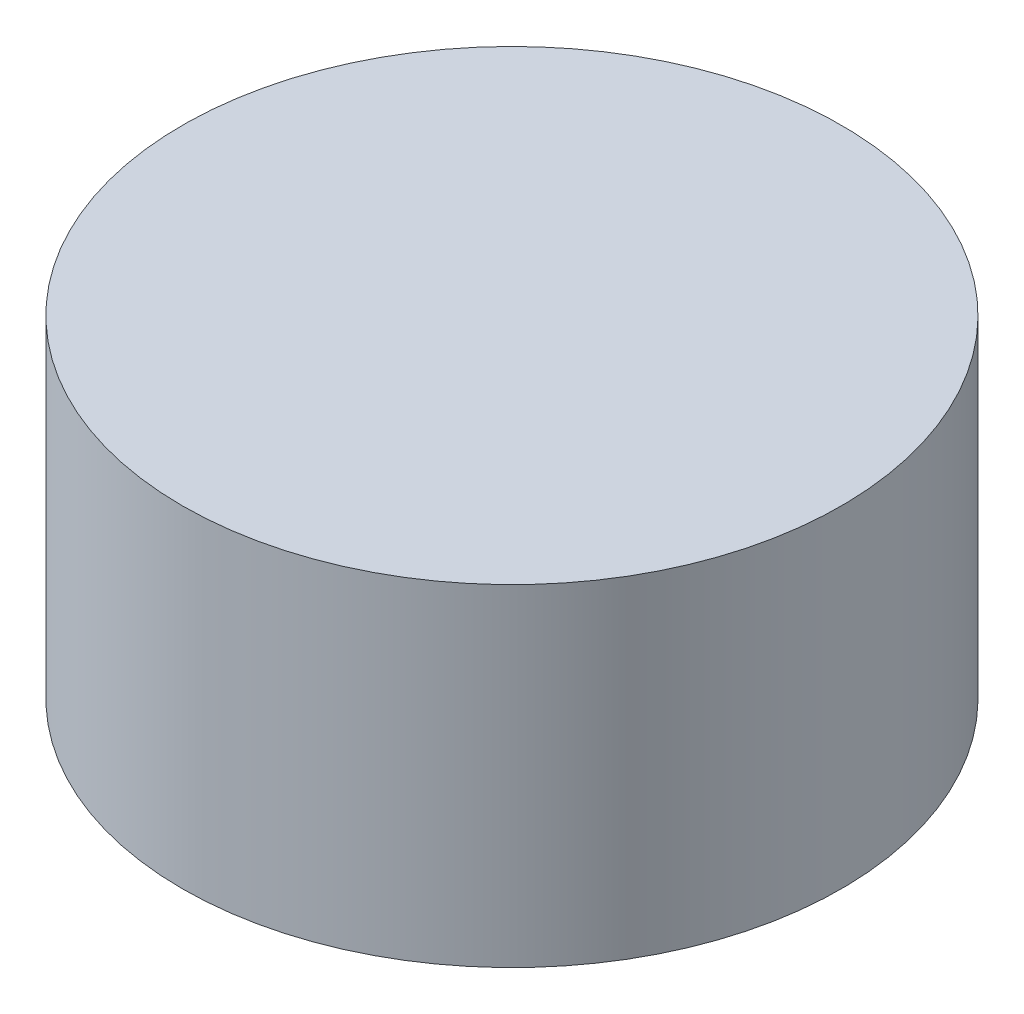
ISO-10303-21;
HEADER;
FILE_DESCRIPTION(('STEP AP214'),'2;1');
FILE_NAME('part.step','',(''),(''),'','','');
FILE_SCHEMA(('AUTOMOTIVE_DESIGN { 1 0 10303 214 1 1 1 1 }'));
ENDSEC;
DATA;
#1=APPLICATION_CONTEXT('core data for automotive mechanical design processes');
#2=APPLICATION_PROTOCOL_DEFINITION('international standard','automotive_design',2000,#1);
#3=PRODUCT_CONTEXT('',#1,'mechanical');
#4=PRODUCT('Part','Part','',(#3));
#5=PRODUCT_RELATED_PRODUCT_CATEGORY('part','',(#4));
#6=PRODUCT_DEFINITION_FORMATION('','',#4);
#7=PRODUCT_DEFINITION_CONTEXT('part definition',#1,'design');
#8=PRODUCT_DEFINITION('design','',#6,#7);
#9=PRODUCT_DEFINITION_SHAPE('','',#8);
#10=(LENGTH_UNIT() NAMED_UNIT(*) SI_UNIT(.MILLI.,.METRE.));
#11=(NAMED_UNIT(*) PLANE_ANGLE_UNIT() SI_UNIT($,.RADIAN.));
#12=(NAMED_UNIT(*) SI_UNIT($,.STERADIAN.) SOLID_ANGLE_UNIT());
#13=UNCERTAINTY_MEASURE_WITH_UNIT(LENGTH_MEASURE(1.E-05),#10,'distance_accuracy_value','');
#14=(GEOMETRIC_REPRESENTATION_CONTEXT(3) GLOBAL_UNCERTAINTY_ASSIGNED_CONTEXT((#13)) GLOBAL_UNIT_ASSIGNED_CONTEXT((#10,
#11,#12)) REPRESENTATION_CONTEXT('',''));
#15=CARTESIAN_POINT('',(0.,0.,0.));
#16=DIRECTION('',(0.,0.,1.));
#17=DIRECTION('',(1.,0.,0.));
#18=AXIS2_PLACEMENT_3D('',#15,#16,#17);
#19=CARTESIAN_POINT('',(0.,2.0066,0.));
#20=DIRECTION('',(0.,-1.,0.));
#21=DIRECTION('',(0.,0.,-1.));
#22=AXIS2_PLACEMENT_3D('',#19,#20,#21);
#23=CYLINDRICAL_SURFACE('',#22,1.9939);
#24=CARTESIAN_POINT('',(0.,2.0066,0.));
#25=DIRECTION('',(0.,1.,0.));
#26=DIRECTION('',(0.,0.,1.));
#27=AXIS2_PLACEMENT_3D('',#24,#25,#26);
#28=CIRCLE('',#27,1.9939);
#29=CARTESIAN_POINT('',(0.,2.0066,1.9939));
#30=VERTEX_POINT('',#29);
#31=EDGE_CURVE('E10',#30,#30,#28,.T.);
#32=ORIENTED_EDGE('',*,*,#31,.F.);
#33=EDGE_LOOP('',(#32));
#34=FACE_BOUND('',#33,.T.);
#35=CARTESIAN_POINT('',(0.,0.,0.));
#36=DIRECTION('',(0.,1.,0.));
#37=DIRECTION('',(0.,0.,1.));
#38=AXIS2_PLACEMENT_3D('',#35,#36,#37);
#39=CIRCLE('',#38,1.9939);
#40=CARTESIAN_POINT('',(0.,0.,1.9939));
#41=VERTEX_POINT('',#40);
#42=EDGE_CURVE('E40',#41,#41,#39,.T.);
#43=ORIENTED_EDGE('',*,*,#42,.T.);
#44=EDGE_LOOP('',(#43));
#45=FACE_BOUND('',#44,.T.);
#46=ADVANCED_FACE('F37',(#34,#45),#23,.T.);
#47=CARTESIAN_POINT('',(0.,2.0066,0.));
#48=DIRECTION('',(0.,1.,0.));
#49=DIRECTION('',(0.,0.,1.));
#50=AXIS2_PLACEMENT_3D('',#47,#48,#49);
#51=PLANE('',#50);
#52=ORIENTED_EDGE('',*,*,#31,.T.);
#53=EDGE_LOOP('',(#52));
#54=FACE_BOUND('',#53,.T.);
#55=ADVANCED_FACE('F54',(#54),#51,.T.);
#56=CARTESIAN_POINT('',(0.,0.,0.));
#57=DIRECTION('',(0.,1.,0.));
#58=DIRECTION('',(0.,0.,1.));
#59=AXIS2_PLACEMENT_3D('',#56,#57,#58);
#60=PLANE('',#59);
#61=ORIENTED_EDGE('',*,*,#42,.F.);
#62=EDGE_LOOP('',(#61));
#63=FACE_BOUND('',#62,.T.);
#64=ADVANCED_FACE('F52',(#63),#60,.F.);
#65=CLOSED_SHELL('',(#46,#55,#64));
#66=MANIFOLD_SOLID_BREP('B2',#65);
#67=ADVANCED_BREP_SHAPE_REPRESENTATION('',(#18,#66),#14);
#68=SHAPE_DEFINITION_REPRESENTATION(#9,#67);
ENDSEC;
END-ISO-10303-21;
